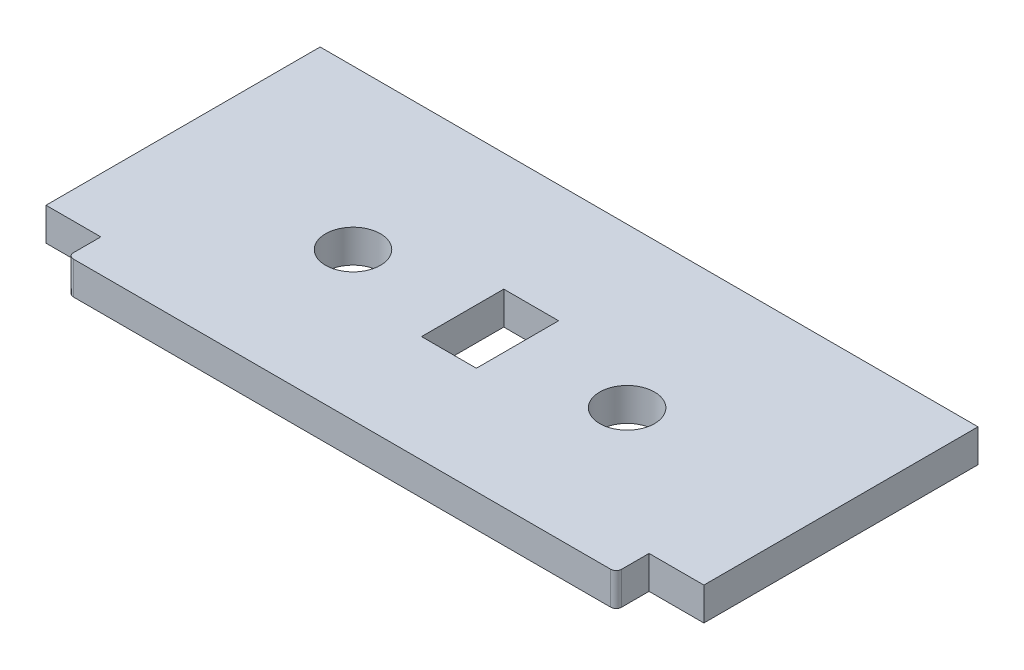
from build123d import *

# Parameters (mm, degrees)
SKETCH1_R           = 5
SKETCH1_W           = 10
SKETCH1_H           = 15
BOSS_EXTRUDE1_DEPTH = 6
FILLET1_R           = 1


with BuildPart() as part:
    # Sketch1 → Boss-Extrude1 (new body)
    with BuildSketch(Plane(origin=(0, 0, 0), x_dir=(1, 0, 0), z_dir=(0, 1, 0))):
        Polygon((-60, 25), (60, 25), (60, -25), (50, -25), (50, -31), (-50, -31), (-50, -25), (-60, -25), align=None)
        with Locations(Location((-25, -4, 0), (0, 0, 270))):
            Circle(SKETCH1_R, mode=Mode.SUBTRACT)
        with Locations(Location((25, -4, 0), (0, 0, 90))):
            Circle(SKETCH1_R, mode=Mode.SUBTRACT)
        with Locations((0, -4)):
            Rectangle(SKETCH1_W, SKETCH1_H, mode=Mode.SUBTRACT)
    extrude(amount=BOSS_EXTRUDE1_DEPTH)

    # Fillet1
    fillet1_edges = [part.edges().sort_by_distance(p)[0] for p in [
        (50, 3, 31),
        (-50, 3, 31),
    ]]
    fillet(fillet1_edges, radius=FILLET1_R)


solid = part.part
